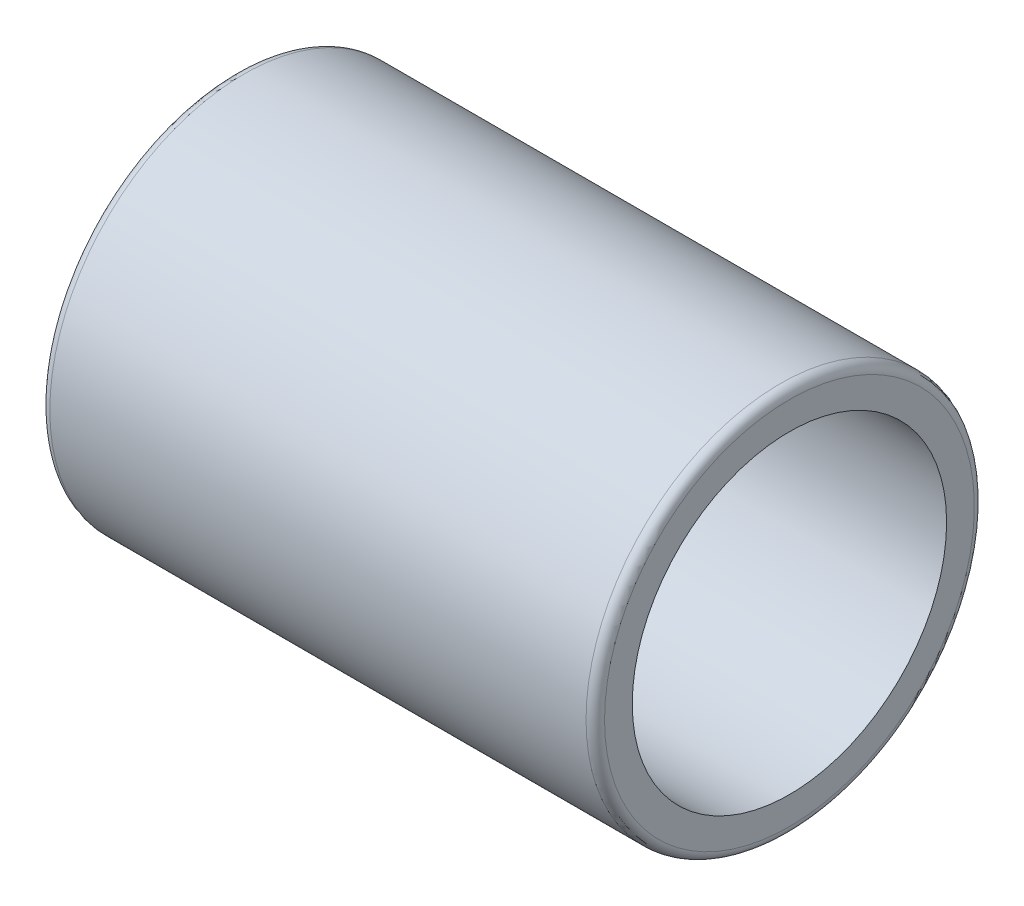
ISO-10303-21;
HEADER;
FILE_DESCRIPTION(('STEP AP214'),'2;1');
FILE_NAME('part.step','',(''),(''),'','','');
FILE_SCHEMA(('AUTOMOTIVE_DESIGN { 1 0 10303 214 1 1 1 1 }'));
ENDSEC;
DATA;
#1=APPLICATION_CONTEXT('core data for automotive mechanical design processes');
#2=APPLICATION_PROTOCOL_DEFINITION('international standard','automotive_design',2000,#1);
#3=PRODUCT_CONTEXT('',#1,'mechanical');
#4=PRODUCT('Part','Part','',(#3));
#5=PRODUCT_RELATED_PRODUCT_CATEGORY('part','',(#4));
#6=PRODUCT_DEFINITION_FORMATION('','',#4);
#7=PRODUCT_DEFINITION_CONTEXT('part definition',#1,'design');
#8=PRODUCT_DEFINITION('design','',#6,#7);
#9=PRODUCT_DEFINITION_SHAPE('','',#8);
#10=(LENGTH_UNIT() NAMED_UNIT(*) SI_UNIT(.MILLI.,.METRE.));
#11=(NAMED_UNIT(*) PLANE_ANGLE_UNIT() SI_UNIT($,.RADIAN.));
#12=(NAMED_UNIT(*) SI_UNIT($,.STERADIAN.) SOLID_ANGLE_UNIT());
#13=UNCERTAINTY_MEASURE_WITH_UNIT(LENGTH_MEASURE(1.E-05),#10,'distance_accuracy_value','');
#14=(GEOMETRIC_REPRESENTATION_CONTEXT(3) GLOBAL_UNCERTAINTY_ASSIGNED_CONTEXT((#13)) GLOBAL_UNIT_ASSIGNED_CONTEXT((#10,
#11,#12)) REPRESENTATION_CONTEXT('',''));
#15=CARTESIAN_POINT('',(0.,0.,0.));
#16=DIRECTION('',(0.,0.,1.));
#17=DIRECTION('',(1.,0.,0.));
#18=AXIS2_PLACEMENT_3D('',#15,#16,#17);
#19=CARTESIAN_POINT('',(0.,0.,0.));
#20=DIRECTION('',(-1.,0.,0.));
#21=DIRECTION('',(0.,0.,1.));
#22=AXIS2_PLACEMENT_3D('',#19,#20,#21);
#23=CYLINDRICAL_SURFACE('',#22,6.);
#24=CARTESIAN_POINT('',(1.99999999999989,0.,0.));
#25=DIRECTION('',(-1.,0.,0.));
#26=DIRECTION('',(0.,0.,1.));
#27=AXIS2_PLACEMENT_3D('',#24,#25,#26);
#28=CIRCLE('',#27,6.);
#29=CARTESIAN_POINT('',(1.99999999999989,0.,6.));
#30=VERTEX_POINT('',#29);
#31=EDGE_CURVE('E43',#30,#30,#28,.T.);
#32=ORIENTED_EDGE('',*,*,#31,.F.);
#33=EDGE_LOOP('',(#32));
#34=FACE_BOUND('',#33,.T.);
#35=CARTESIAN_POINT('',(0.,0.,0.));
#36=DIRECTION('',(-1.,0.,0.));
#37=DIRECTION('',(0.,0.,1.));
#38=AXIS2_PLACEMENT_3D('',#35,#36,#37);
#39=CIRCLE('',#38,6.);
#40=CARTESIAN_POINT('',(0.,0.,6.));
#41=VERTEX_POINT('',#40);
#42=EDGE_CURVE('E34',#41,#41,#39,.T.);
#43=ORIENTED_EDGE('',*,*,#42,.T.);
#44=EDGE_LOOP('',(#43));
#45=FACE_BOUND('',#44,.T.);
#46=ADVANCED_FACE('F14',(#34,#45),#23,.F.);
#47=CARTESIAN_POINT('',(0.,6.,0.));
#48=DIRECTION('',(1.,0.,0.));
#49=DIRECTION('',(0.,0.,-1.));
#50=AXIS2_PLACEMENT_3D('',#47,#48,#49);
#51=PLANE('',#50);
#52=CARTESIAN_POINT('',(0.,0.,0.));
#53=DIRECTION('',(1.,0.,0.));
#54=DIRECTION('',(0.,0.,-1.));
#55=AXIS2_PLACEMENT_3D('',#52,#53,#54);
#56=CIRCLE('',#55,20.);
#57=CARTESIAN_POINT('',(0.,0.,-20.));
#58=VERTEX_POINT('',#57);
#59=EDGE_CURVE('E21',#58,#58,#56,.F.);
#60=ORIENTED_EDGE('',*,*,#59,.T.);
#61=EDGE_LOOP('',(#60));
#62=FACE_BOUND('',#61,.T.);
#63=ORIENTED_EDGE('',*,*,#42,.F.);
#64=EDGE_LOOP('',(#63));
#65=FACE_BOUND('',#64,.T.);
#66=ADVANCED_FACE('F51',(#62,#65),#51,.F.);
#67=CARTESIAN_POINT('',(0.,0.,0.));
#68=DIRECTION('',(-1.,0.,0.));
#69=DIRECTION('',(0.,0.,1.));
#70=AXIS2_PLACEMENT_3D('',#67,#68,#69);
#71=CYLINDRICAL_SURFACE('',#70,21.);
#72=CARTESIAN_POINT('',(1.,0.,0.));
#73=DIRECTION('',(1.,0.,0.));
#74=DIRECTION('',(0.,0.,-1.));
#75=AXIS2_PLACEMENT_3D('',#72,#73,#74);
#76=CIRCLE('',#75,21.);
#77=CARTESIAN_POINT('',(1.,0.,-21.));
#78=VERTEX_POINT('',#77);
#79=EDGE_CURVE('E9',#78,#78,#76,.T.);
#80=ORIENTED_EDGE('',*,*,#79,.T.);
#81=EDGE_LOOP('',(#80));
#82=FACE_BOUND('',#81,.T.);
#83=CARTESIAN_POINT('',(59.,0.,0.));
#84=DIRECTION('',(-1.,0.,0.));
#85=DIRECTION('',(0.,0.,1.));
#86=AXIS2_PLACEMENT_3D('',#83,#84,#85);
#87=CIRCLE('',#86,21.);
#88=CARTESIAN_POINT('',(59.,0.,21.));
#89=VERTEX_POINT('',#88);
#90=EDGE_CURVE('E29',#89,#89,#87,.T.);
#91=ORIENTED_EDGE('',*,*,#90,.T.);
#92=EDGE_LOOP('',(#91));
#93=FACE_BOUND('',#92,.T.);
#94=ADVANCED_FACE('F56',(#82,#93),#71,.T.);
#95=CARTESIAN_POINT('',(60.,21.,0.));
#96=DIRECTION('',(-1.,0.,0.));
#97=DIRECTION('',(0.,0.,1.));
#98=AXIS2_PLACEMENT_3D('',#95,#96,#97);
#99=PLANE('',#98);
#100=CARTESIAN_POINT('',(60.,0.,0.));
#101=DIRECTION('',(-1.,0.,0.));
#102=DIRECTION('',(0.,0.,1.));
#103=AXIS2_PLACEMENT_3D('',#100,#101,#102);
#104=CIRCLE('',#103,20.);
#105=CARTESIAN_POINT('',(60.,0.,20.));
#106=VERTEX_POINT('',#105);
#107=EDGE_CURVE('E25',#106,#106,#104,.F.);
#108=ORIENTED_EDGE('',*,*,#107,.T.);
#109=EDGE_LOOP('',(#108));
#110=FACE_BOUND('',#109,.T.);
#111=CARTESIAN_POINT('',(60.,0.,0.));
#112=DIRECTION('',(-1.,0.,0.));
#113=DIRECTION('',(0.,0.,1.));
#114=AXIS2_PLACEMENT_3D('',#111,#112,#113);
#115=CIRCLE('',#114,17.);
#116=CARTESIAN_POINT('',(60.,0.,17.));
#117=VERTEX_POINT('',#116);
#118=EDGE_CURVE('E37',#117,#117,#115,.T.);
#119=ORIENTED_EDGE('',*,*,#118,.T.);
#120=EDGE_LOOP('',(#119));
#121=FACE_BOUND('',#120,.T.);
#122=ADVANCED_FACE('F63',(#110,#121),#99,.F.);
#123=CARTESIAN_POINT('',(0.,0.,0.));
#124=DIRECTION('',(-1.,0.,0.));
#125=DIRECTION('',(0.,0.,1.));
#126=AXIS2_PLACEMENT_3D('',#123,#124,#125);
#127=CYLINDRICAL_SURFACE('',#126,17.);
#128=ORIENTED_EDGE('',*,*,#118,.F.);
#129=EDGE_LOOP('',(#128));
#130=FACE_BOUND('',#129,.T.);
#131=CARTESIAN_POINT('',(13.,0.,0.));
#132=DIRECTION('',(-1.,0.,0.));
#133=DIRECTION('',(0.,0.,1.));
#134=AXIS2_PLACEMENT_3D('',#131,#132,#133);
#135=CIRCLE('',#134,17.);
#136=CARTESIAN_POINT('',(13.,0.,17.));
#137=VERTEX_POINT('',#136);
#138=EDGE_CURVE('E40',#137,#137,#135,.T.);
#139=ORIENTED_EDGE('',*,*,#138,.T.);
#140=EDGE_LOOP('',(#139));
#141=FACE_BOUND('',#140,.T.);
#142=ADVANCED_FACE('F75',(#130,#141),#127,.F.);
#143=CARTESIAN_POINT('',(1.99999999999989,0.,0.));
#144=DIRECTION('',(1.,0.,0.));
#145=DIRECTION('',(0.,0.,-1.));
#146=AXIS2_PLACEMENT_3D('',#143,#144,#145);
#147=CONICAL_SURFACE('',#146,6.,0.785398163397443);
#148=ORIENTED_EDGE('',*,*,#138,.F.);
#149=EDGE_LOOP('',(#148));
#150=FACE_BOUND('',#149,.T.);
#151=ORIENTED_EDGE('',*,*,#31,.T.);
#152=EDGE_LOOP('',(#151));
#153=FACE_BOUND('',#152,.T.);
#154=ADVANCED_FACE('F47',(#150,#153),#147,.F.);
#155=CARTESIAN_POINT('',(59.,0.,0.));
#156=DIRECTION('',(-1.,0.,0.));
#157=DIRECTION('',(0.,0.,1.));
#158=AXIS2_PLACEMENT_3D('',#155,#156,#157);
#159=TOROIDAL_SURFACE('',#158,20.,1.);
#160=ORIENTED_EDGE('',*,*,#107,.F.);
#161=EDGE_LOOP('',(#160));
#162=FACE_BOUND('',#161,.T.);
#163=ORIENTED_EDGE('',*,*,#90,.F.);
#164=EDGE_LOOP('',(#163));
#165=FACE_BOUND('',#164,.T.);
#166=ADVANCED_FACE('F66',(#162,#165),#159,.T.);
#167=CARTESIAN_POINT('',(1.,0.,0.));
#168=DIRECTION('',(1.,0.,0.));
#169=DIRECTION('',(0.,0.,-1.));
#170=AXIS2_PLACEMENT_3D('',#167,#168,#169);
#171=TOROIDAL_SURFACE('',#170,20.,1.);
#172=ORIENTED_EDGE('',*,*,#79,.F.);
#173=EDGE_LOOP('',(#172));
#174=FACE_BOUND('',#173,.T.);
#175=ORIENTED_EDGE('',*,*,#59,.F.);
#176=EDGE_LOOP('',(#175));
#177=FACE_BOUND('',#176,.T.);
#178=ADVANCED_FACE('F16',(#174,#177),#171,.T.);
#179=CLOSED_SHELL('',(#46,#66,#94,#122,#142,#154,#166,#178));
#180=MANIFOLD_SOLID_BREP('B1',#179);
#181=ADVANCED_BREP_SHAPE_REPRESENTATION('',(#18,#180),#14);
#182=SHAPE_DEFINITION_REPRESENTATION(#9,#181);
ENDSEC;
END-ISO-10303-21;
